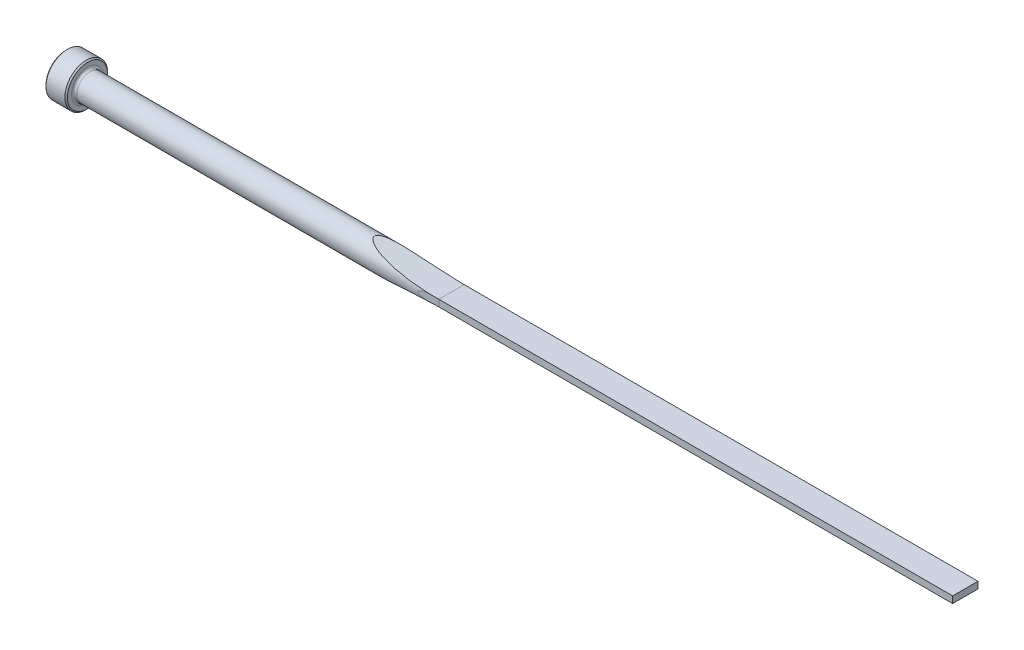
from build123d import *

# Parameters (mm, degrees)
CUT_EXTRUDE1_DEPTH = 267.851147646
CUT_EXTRUDE2_DEPTH = 267.851147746
FILLET1_R          = 0.762
CHAMFER1_SIZE      = 0.381


with BuildPart() as part:
    # Sketch1 → Revolve1 (revolve)
    with BuildSketch(Plane.XY, mode=Mode.PRIVATE) as revolve1_sk:
        Polygon((0, 0), (0, 6.35), (6.35, 6.35), (6.35, 3.9624), (266.7, 3.9624), (266.7, 0), align=None)
    revolve(revolve1_sk.sketch.rotate(Axis((0, 0, 0), (1, 0, 0)), 90), axis=Axis((0, 0, 0), (1, 0, 0)))

    # Sketch2 → Cut-Extrude1 (cut, symmetric)
    with BuildSketch(Plane.XY):
        with BuildLine():
            Line((266.7, 3.9624), (266.7, 0.9906))
            Line((266.7, 0.9906), (114.3, 0.9906))
            ThreePointArc((114.3, 0.9906), (102.806675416, 1.736680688), (91.506263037, 3.9624))
            Line((91.506263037, 3.9624), (266.7, 3.9624))
        make_face()
    cut_extrude1 = extrude(amount=CUT_EXTRUDE1_DEPTH, both=True, mode=Mode.SUBTRACT)

    # Mirror1: Cut-Extrude1 across plane
    add(cut_extrude1.mirror(Plane.ZX), mode=Mode.SUBTRACT)

    # Sketch3 → Cut-Extrude2 (cut, symmetric)
    with BuildSketch(Plane(origin=(0, 0, 0), x_dir=(1, 0, 0), z_dir=(0, 1, 0))):
        with BuildLine():
            Line((266.7, 3.9624), (266.7, 3.7592))
            Line((266.7, 3.7592), (114.3, 3.7592))
            ThreePointArc((114.3, 3.7592), (111.29463147, 3.810014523), (108.292698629, 3.9624))
            Line((108.292698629, 3.9624), (266.7, 3.9624))
        make_face()
    cut_extrude2 = extrude(amount=CUT_EXTRUDE2_DEPTH, both=True, mode=Mode.SUBTRACT)

    # Mirror2: Cut-Extrude2 across plane
    add(cut_extrude2.mirror(Plane.XY), mode=Mode.SUBTRACT)

    # Fillet1
    fillet1_edges = [part.edges().sort_by_distance(p)[0] for p in [
        (6.35, 0, -3.9624),
    ]]
    fillet(fillet1_edges, radius=FILLET1_R)

    # Chamfer1
    chamfer1_edges = [part.edges().sort_by_distance(p)[0] for p in [
        (6.35, 0, -6.35),
        (0, 0, -6.35),
    ]]
    chamfer(chamfer1_edges, length=CHAMFER1_SIZE)


solid = part.part
